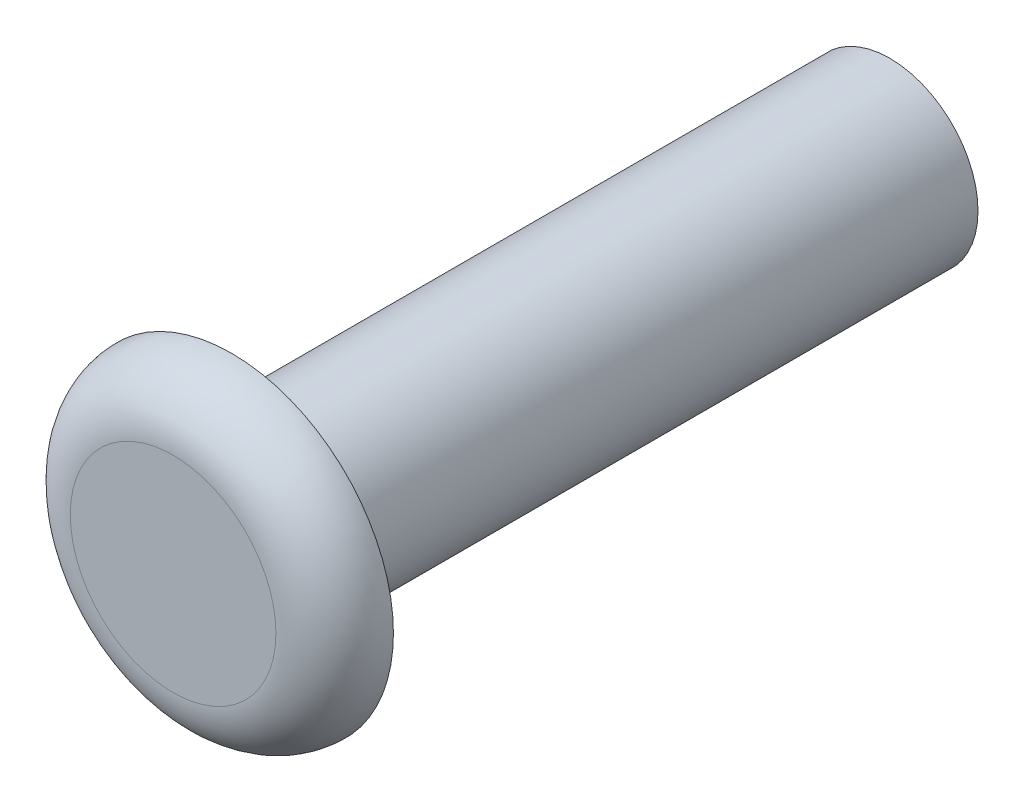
ISO-10303-21;
HEADER;
FILE_DESCRIPTION(('STEP AP214'),'2;1');
FILE_NAME('part.step','',(''),(''),'','','');
FILE_SCHEMA(('AUTOMOTIVE_DESIGN { 1 0 10303 214 1 1 1 1 }'));
ENDSEC;
DATA;
#1=APPLICATION_CONTEXT('core data for automotive mechanical design processes');
#2=APPLICATION_PROTOCOL_DEFINITION('international standard','automotive_design',2000,#1);
#3=PRODUCT_CONTEXT('',#1,'mechanical');
#4=PRODUCT('Part','Part','',(#3));
#5=PRODUCT_RELATED_PRODUCT_CATEGORY('part','',(#4));
#6=PRODUCT_DEFINITION_FORMATION('','',#4);
#7=PRODUCT_DEFINITION_CONTEXT('part definition',#1,'design');
#8=PRODUCT_DEFINITION('design','',#6,#7);
#9=PRODUCT_DEFINITION_SHAPE('','',#8);
#10=(LENGTH_UNIT() NAMED_UNIT(*) SI_UNIT(.MILLI.,.METRE.));
#11=(NAMED_UNIT(*) PLANE_ANGLE_UNIT() SI_UNIT($,.RADIAN.));
#12=(NAMED_UNIT(*) SI_UNIT($,.STERADIAN.) SOLID_ANGLE_UNIT());
#13=UNCERTAINTY_MEASURE_WITH_UNIT(LENGTH_MEASURE(1.E-05),#10,'distance_accuracy_value','');
#14=(GEOMETRIC_REPRESENTATION_CONTEXT(3) GLOBAL_UNCERTAINTY_ASSIGNED_CONTEXT((#13)) GLOBAL_UNIT_ASSIGNED_CONTEXT((#10,
#11,#12)) REPRESENTATION_CONTEXT('',''));
#15=CARTESIAN_POINT('',(0.,0.,0.));
#16=DIRECTION('',(0.,0.,1.));
#17=DIRECTION('',(1.,0.,0.));
#18=AXIS2_PLACEMENT_3D('',#15,#16,#17);
#19=CARTESIAN_POINT('',(-10.8900369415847,3.08761918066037,-11.2));
#20=DIRECTION('',(0.,0.,-1.));
#21=DIRECTION('',(-1.,0.,0.));
#22=AXIS2_PLACEMENT_3D('',#19,#20,#21);
#23=PLANE('',#22);
#24=CARTESIAN_POINT('',(-10.8900369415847,3.08761918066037,-11.2));
#25=DIRECTION('',(0.,0.,-1.));
#26=DIRECTION('',(-1.,0.,0.));
#27=AXIS2_PLACEMENT_3D('',#24,#25,#26);
#28=CIRCLE('',#27,1.025);
#29=CARTESIAN_POINT('',(-11.9150369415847,3.08761918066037,-11.2));
#30=VERTEX_POINT('',#29);
#31=EDGE_CURVE('E62',#30,#30,#28,.T.);
#32=ORIENTED_EDGE('',*,*,#31,.F.);
#33=EDGE_LOOP('',(#32));
#34=FACE_BOUND('',#33,.T.);
#35=CARTESIAN_POINT('',(-10.8900369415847,3.08761918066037,-11.2));
#36=DIRECTION('',(0.,0.,-1.));
#37=DIRECTION('',(-1.,0.,0.));
#38=AXIS2_PLACEMENT_3D('',#35,#36,#37);
#39=CIRCLE('',#38,1.5);
#40=CARTESIAN_POINT('',(-12.3900369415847,3.08761918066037,-11.2));
#41=VERTEX_POINT('',#40);
#42=EDGE_CURVE('E49',#41,#41,#39,.F.);
#43=ORIENTED_EDGE('',*,*,#42,.F.);
#44=EDGE_LOOP('',(#43));
#45=FACE_BOUND('',#44,.T.);
#46=ADVANCED_FACE('F42',(#34,#45),#23,.T.);
#47=CARTESIAN_POINT('',(-10.8900369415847,3.08761918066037,-15.4426406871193));
#48=DIRECTION('',(0.,0.,1.));
#49=DIRECTION('',(1.,0.,0.));
#50=AXIS2_PLACEMENT_3D('',#47,#48,#49);
#51=CYLINDRICAL_SURFACE('',#50,1.5);
#52=CARTESIAN_POINT('',(-10.8900369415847,3.08761918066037,0.));
#53=DIRECTION('',(0.,0.,1.));
#54=DIRECTION('',(1.,0.,0.));
#55=AXIS2_PLACEMENT_3D('',#52,#53,#54);
#56=CIRCLE('',#55,1.5);
#57=CARTESIAN_POINT('',(-9.39003694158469,3.08761918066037,0.));
#58=VERTEX_POINT('',#57);
#59=EDGE_CURVE('E65',#58,#58,#56,.T.);
#60=ORIENTED_EDGE('',*,*,#59,.F.);
#61=EDGE_LOOP('',(#60));
#62=FACE_BOUND('',#61,.T.);
#63=ORIENTED_EDGE('',*,*,#42,.T.);
#64=EDGE_LOOP('',(#63));
#65=FACE_BOUND('',#64,.T.);
#66=ADVANCED_FACE('F74',(#62,#65),#51,.T.);
#67=CARTESIAN_POINT('',(-10.8900369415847,3.08761918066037,1.));
#68=DIRECTION('',(0.,0.,1.));
#69=DIRECTION('',(1.,0.,0.));
#70=AXIS2_PLACEMENT_3D('',#67,#68,#69);
#71=PLANE('',#70);
#72=CARTESIAN_POINT('',(-10.8900369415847,3.08761918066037,1.));
#73=DIRECTION('',(0.,0.,1.));
#74=DIRECTION('',(1.,0.,0.));
#75=AXIS2_PLACEMENT_3D('',#72,#73,#74);
#76=CIRCLE('',#75,1.75);
#77=CARTESIAN_POINT('',(-9.14003694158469,3.08761918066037,1.));
#78=VERTEX_POINT('',#77);
#79=EDGE_CURVE('E11',#78,#78,#76,.T.);
#80=ORIENTED_EDGE('',*,*,#79,.T.);
#81=EDGE_LOOP('',(#80));
#82=FACE_BOUND('',#81,.T.);
#83=ADVANCED_FACE('F81',(#82),#71,.T.);
#84=CARTESIAN_POINT('',(-10.8900369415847,3.08761918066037,0.));
#85=DIRECTION('',(0.,0.,1.));
#86=DIRECTION('',(1.,0.,0.));
#87=AXIS2_PLACEMENT_3D('',#84,#85,#86);
#88=PLANE('',#87);
#89=ORIENTED_EDGE('',*,*,#59,.T.);
#90=EDGE_LOOP('',(#89));
#91=FACE_BOUND('',#90,.T.);
#92=CARTESIAN_POINT('',(-10.8900369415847,3.08761918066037,0.));
#93=DIRECTION('',(0.,0.,1.));
#94=DIRECTION('',(1.,0.,0.));
#95=AXIS2_PLACEMENT_3D('',#92,#93,#94);
#96=CIRCLE('',#95,2.75);
#97=CARTESIAN_POINT('',(-8.14003694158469,3.08761918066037,0.));
#98=VERTEX_POINT('',#97);
#99=EDGE_CURVE('E61',#98,#98,#96,.T.);
#100=ORIENTED_EDGE('',*,*,#99,.F.);
#101=EDGE_LOOP('',(#100));
#102=FACE_BOUND('',#101,.T.);
#103=ADVANCED_FACE('F86',(#91,#102),#88,.F.);
#104=CARTESIAN_POINT('',(-10.8900369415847,3.08761918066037,0.));
#105=DIRECTION('',(0.,0.,1.));
#106=DIRECTION('',(1.,0.,0.));
#107=AXIS2_PLACEMENT_3D('',#104,#105,#106);
#108=TOROIDAL_SURFACE('',#107,1.75,1.);
#109=ORIENTED_EDGE('',*,*,#99,.T.);
#110=EDGE_LOOP('',(#109));
#111=FACE_BOUND('',#110,.T.);
#112=ORIENTED_EDGE('',*,*,#79,.F.);
#113=EDGE_LOOP('',(#112));
#114=FACE_BOUND('',#113,.T.);
#115=ADVANCED_FACE('F44',(#111,#114),#108,.T.);
#116=CARTESIAN_POINT('',(-10.8900369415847,3.08761918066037,-4.85));
#117=DIRECTION('',(0.,0.,-1.));
#118=DIRECTION('',(-1.,0.,0.));
#119=AXIS2_PLACEMENT_3D('',#116,#117,#118);
#120=CONICAL_SURFACE('',#119,1.025,1.02974425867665);
#121=CARTESIAN_POINT('',(-10.8900369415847,3.08761918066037,-4.23411786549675));
#122=VERTEX_POINT('',#121);
#123=VERTEX_LOOP('',#122);
#124=FACE_BOUND('',#123,.T.);
#125=CARTESIAN_POINT('',(-10.8900369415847,3.08761918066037,-4.85));
#126=DIRECTION('',(0.,0.,-1.));
#127=DIRECTION('',(-1.,0.,0.));
#128=AXIS2_PLACEMENT_3D('',#125,#126,#127);
#129=CIRCLE('',#128,1.025);
#130=CARTESIAN_POINT('',(-11.9150369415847,3.08761918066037,-4.85));
#131=VERTEX_POINT('',#130);
#132=EDGE_CURVE('E59',#131,#131,#129,.T.);
#133=ORIENTED_EDGE('',*,*,#132,.T.);
#134=EDGE_LOOP('',(#133));
#135=FACE_BOUND('',#134,.T.);
#136=ADVANCED_FACE('F52',(#124,#135),#120,.F.);
#137=CARTESIAN_POINT('',(-10.8900369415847,3.08761918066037,-11.2));
#138=DIRECTION('',(0.,0.,-1.));
#139=DIRECTION('',(-1.,0.,0.));
#140=AXIS2_PLACEMENT_3D('',#137,#138,#139);
#141=CYLINDRICAL_SURFACE('',#140,1.025);
#142=ORIENTED_EDGE('',*,*,#132,.F.);
#143=EDGE_LOOP('',(#142));
#144=FACE_BOUND('',#143,.T.);
#145=ORIENTED_EDGE('',*,*,#31,.T.);
#146=EDGE_LOOP('',(#145));
#147=FACE_BOUND('',#146,.T.);
#148=ADVANCED_FACE('F55',(#144,#147),#141,.F.);
#149=CLOSED_SHELL('',(#46,#66,#83,#103,#115,#136,#148));
#150=MANIFOLD_SOLID_BREP('B2',#149);
#151=ADVANCED_BREP_SHAPE_REPRESENTATION('',(#18,#150),#14);
#152=SHAPE_DEFINITION_REPRESENTATION(#9,#151);
ENDSEC;
END-ISO-10303-21;
